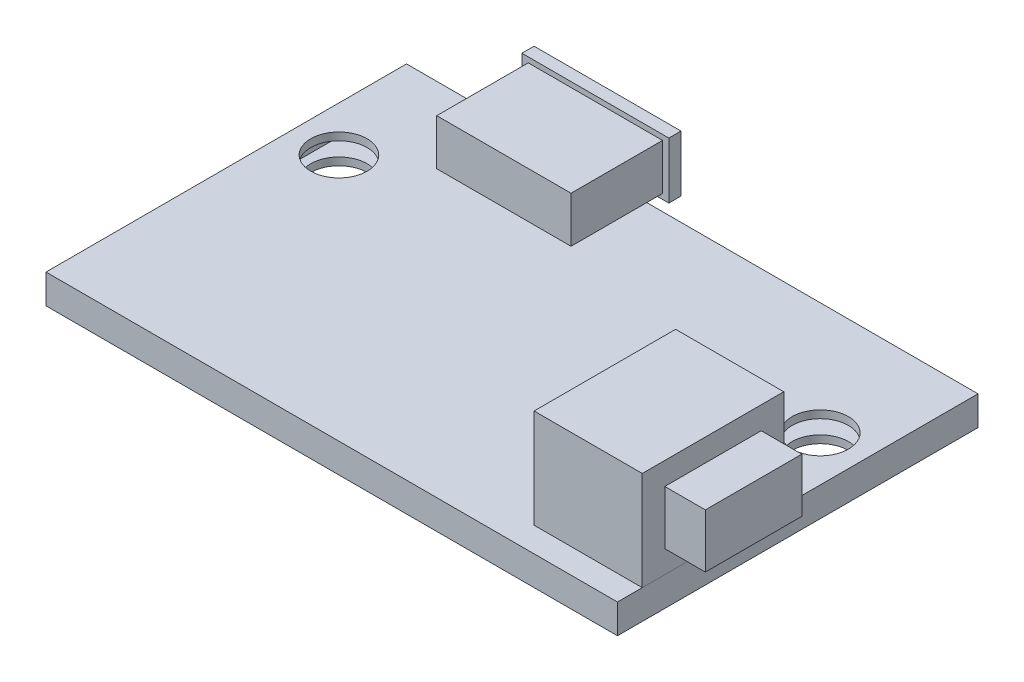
from build123d import *

# Parameters (mm, degrees)
SKETCH1_W           = 32.2072
SKETCH1_H           = 20.32
BOSS_EXTRUDE1_DEPTH = 1.651
SKETCH2_W           = 7.5692
SKETCH2_H           = 5.1562
BOSS_EXTRUDE2_DEPTH = 2.5908
SKETCH3_W           = 8.2804
SKETCH3_H           = 3.175
BOSS_EXTRUDE3_DEPTH = 0.6858
SHELL1_T            = -0.4318
SKETCH4_R           = 1.5875
CUT_EXTRUDE1_DEPTH  = 21.133121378
SKETCH5_W           = 6.096
SKETCH5_H           = 7.9756
BOSS_EXTRUDE4_DEPTH = 5.5753
SHELL2_T            = -1.27
SKETCH6_W           = 5.4356
SKETCH6_H           = 3.0353
BOSS_EXTRUDE5_DEPTH = 7.112


with BuildPart() as part:
    # Sketch1 → Boss-Extrude1 (new body)
    with BuildSketch(Plane(origin=(0, 0, 0), x_dir=(1, 0, 0), z_dir=(0, 1, 0))):
        Rectangle(SKETCH1_W, SKETCH1_H)
    extrude(amount=-BOSS_EXTRUDE1_DEPTH)

    # Sketch2 → Boss-Extrude2 (add)
    with BuildSketch(Plane(origin=(0, 0, 0), x_dir=(1, 0, 0), z_dir=(0, 1, 0))):
        with Locations((-6.35, 8.4709)):
            Rectangle(SKETCH2_W, SKETCH2_H)
    extrude(amount=BOSS_EXTRUDE2_DEPTH)

    # Sketch3 → Boss-Extrude3 (add)
    with BuildSketch(Plane(origin=(0, 0, -11.049), x_dir=(-1, 0, 0), z_dir=(0, 0, -1))):
        with Locations((6.35, 1.2954)):
            Rectangle(SKETCH3_W, SKETCH3_H)
    extrude(amount=BOSS_EXTRUDE3_DEPTH)

    # Shell1
    shell1_openings = [part.faces().sort_by_distance(p)[0] for p in [
        (-6.35, 1.2954, -11.7348),
    ]]
    offset(amount=SHELL1_T, openings=shell1_openings, kind=Kind.INTERSECTION)

    # Sketch4 → Cut-Extrude1 (cut, through all)
    with BuildSketch(Plane(origin=(0, 0, 0), x_dir=(1, 0, 0), z_dir=(0, 1, 0))):
        with Locations(Location((13.5636, 3.81, 0), (0, 0, 270))):
            Circle(SKETCH4_R)
        with Locations(Location((-13.5636, 3.81, 0), (0, 0, 270))):
            Circle(SKETCH4_R)
    extrude(amount=-CUT_EXTRUDE1_DEPTH, mode=Mode.SUBTRACT)


with BuildPart() as body_2:
    # Sketch5 → Boss-Extrude4 (new body)
    with BuildSketch(Plane(origin=(0, 0, 0), x_dir=(1, 0, 0), z_dir=(0, 1, 0))):
        with Locations((13.0556, -4.7752)):
            Rectangle(SKETCH5_W, SKETCH5_H)
    extrude(amount=BOSS_EXTRUDE4_DEPTH)

    # Shell2
    shell2_openings = [body_2.faces().sort_by_distance(p)[0] for p in [
        (16.1036, 2.78765, 4.7752),
    ]]
    offset(amount=SHELL2_T, openings=shell2_openings, kind=Kind.INTERSECTION)


with BuildPart() as body_3:
    # Sketch6 → Boss-Extrude5 (new body)
    with BuildSketch(Plane(origin=(11.2776, 0, 0), x_dir=(0, 0, -1), z_dir=(1, 0, 0))):
        with Locations((-4.7752, 2.78765)):
            Rectangle(SKETCH6_W, SKETCH6_H)
    extrude(amount=BOSS_EXTRUDE5_DEPTH)


solid = Compound([part.part, body_2.part, body_3.part])
